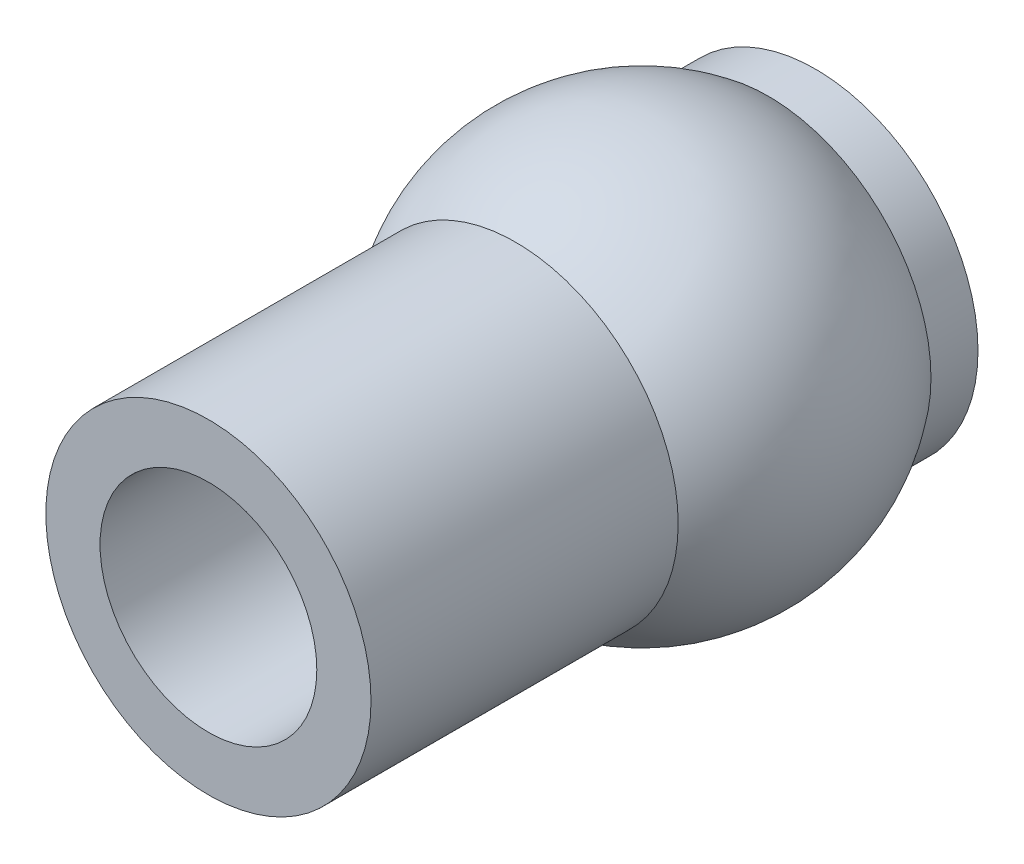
from build123d import *

# Parameters (mm, degrees)
BOSS_EXTRUDE1_DEPTH      = 5.08
BOSS_EXTRUDE1_DEPTH_BACK = 2.032
SKETCH2_R                = 1.905
SKETCH3_R                = 1.27
CUT_EXTRUDE1_DEPTH       = 9.233479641


with BuildPart() as part:
    # Sketch1 → Revolve1 (revolve)
    with BuildSketch(Plane.XY):
        with BuildLine():
            Line((0, -2.413), (0, 2.413))
            ThreePointArc((0, 2.413), (-2.413, 0), (0, -2.413))
        make_face()
    revolve(axis=Axis((0, 3.221416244, 0), (0, -1, 0)))

    # Sketch2 → Boss-Extrude1 (add, two sides: drawn at the far end of the back side and taken through both)
    with BuildSketch(Plane.XY.offset(-BOSS_EXTRUDE1_DEPTH_BACK)):
        Circle(SKETCH2_R)
    extrude(amount=BOSS_EXTRUDE1_DEPTH + BOSS_EXTRUDE1_DEPTH_BACK)

    # Sketch3 → Cut-Extrude1 (cut, through all)
    with BuildSketch(Plane.XY.offset(5.08)):
        Circle(SKETCH3_R)
    extrude(amount=-CUT_EXTRUDE1_DEPTH, mode=Mode.SUBTRACT)


solid = part.part
